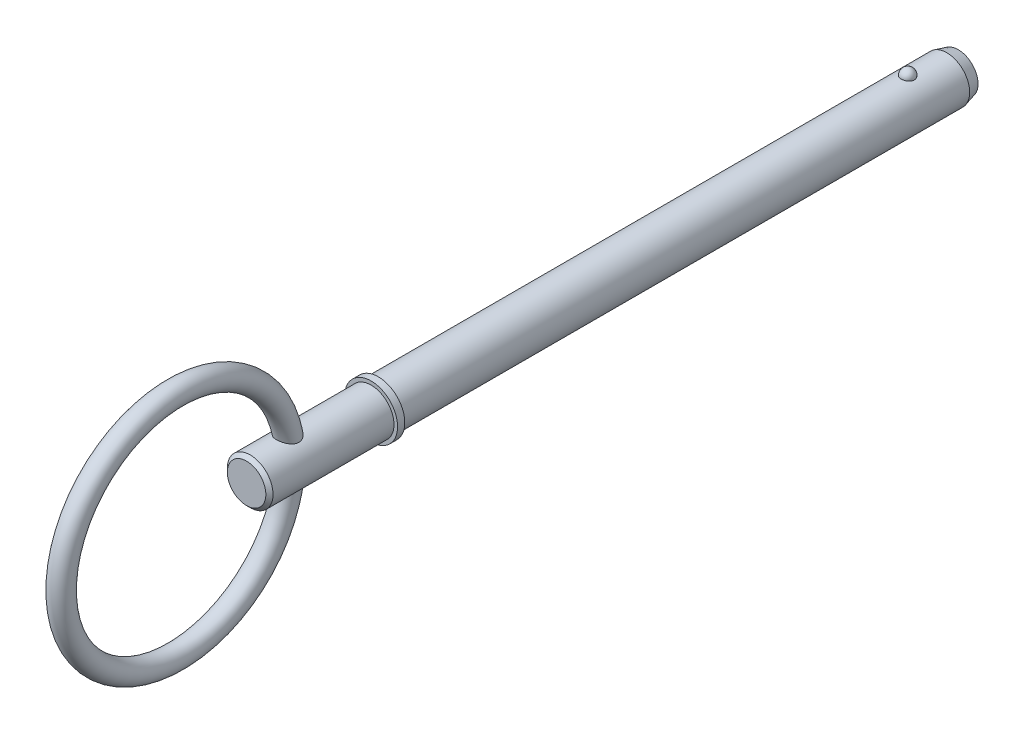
from build123d import *

# Parameters (mm, degrees)
SKETCH2_R           = 3.175
BOSS_EXTRUDE1_DEPTH = 72.6
BOSS_EXTRUDE2_START = 7.92
SKETCH3_R           = 3.175
BOSS_EXTRUDE2_DEPTH = 7.92
CHAMFER1_SIZE       = 1.586
CHAMFER1_SIZE2      = 0.424967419
SKETCH20_W          = 1
SKETCH20_H          = 3.675
SKETCH21_R          = 3.175
BOSS_EXTRUDE3_DEPTH = 18.29
CHAMFER2_SIZE       = 0.5
SKETCH24_R          = 1.5


with BuildPart() as part:
    # Sketch2 → Boss-Extrude1 (new body)
    with BuildSketch(Plane.XY):
        Circle(SKETCH2_R)
    extrude(amount=BOSS_EXTRUDE1_DEPTH)

    # Sketch3 → Boss-Extrude2 (add)
    with BuildSketch(Plane(origin=(0, 0, 0), x_dir=(-1, 0, 0), z_dir=(0, 0, -1)).offset(BOSS_EXTRUDE2_START)):
        Circle(SKETCH3_R)
    extrude(amount=-BOSS_EXTRUDE2_DEPTH)

    # Chamfer1
    chamfer1_edges = [part.edges().sort_by_distance(p)[0] for p in [
        (3.175, 0, -7.92),
    ]]
    chamfer1_side = [part.faces().sort_by_distance(p)[0] for p in [
        (3.175, 0, -3.96),
    ]]
    chamfer(chamfer1_edges, length=CHAMFER1_SIZE, length2=CHAMFER1_SIZE2, reference=chamfer1_side[0])

    # Sketch18 → Revolve1 (revolve)
    with BuildSketch(Plane(origin=(0, 0, 0), x_dir=(0, 0, -1), z_dir=(1, 0, 0))):
        with BuildLine():
            Line((0.91, 4.085), (0.91, 2.265))
            ThreePointArc((0.91, 2.265), (0, 3.175), (0.91, 4.085))
        make_face()
    revolve(axis=Axis((0, 4.085, -0.91), (0, -1, 0)))

    # Sketch20 → Revolve2 (revolve)
    with BuildSketch(Plane(origin=(0, 0, 0), x_dir=(0, 0, -1), z_dir=(1, 0, 0)), mode=Mode.PRIVATE) as revolve2_sk:
        with Locations((-73.1, 1.8375)):
            Rectangle(SKETCH20_W, SKETCH20_H)
    revolve(revolve2_sk.sketch.rotate(Axis((0, 0, 33.728787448), (0, 0, 1)), 90), axis=Axis((0, 0, 33.728787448), (0, 0, 1)))

    # Sketch21 → Boss-Extrude3 (add)
    with BuildSketch(Plane(origin=(0, 0, 72.6), x_dir=(-1, 0, 0), z_dir=(0, 0, -1))):
        Circle(SKETCH21_R)
    extrude(amount=-BOSS_EXTRUDE3_DEPTH)

    # Chamfer2
    chamfer2_edges = [part.edges().sort_by_distance(p)[0] for p in [
        (3.175, 0, 90.89),
    ]]
    chamfer(chamfer2_edges, length=CHAMFER2_SIZE)

    # Sweep1: sweep along a path in Sketch23
    with BuildLine(Plane(origin=(0, 0, 0), x_dir=(0, 0, -1), z_dir=(1, 0, 0))) as sweep1_path:
        CenterArc((-100.765, 0), 15.875, 0, 360)
    # Sketch24 → Sweep1 (sweep)
    with BuildSketch(Plane(origin=(0, 0, 0), x_dir=(1, 0, 0), z_dir=(0, 1, 0))):
        with Locations((0, -84.89)):
            Circle(SKETCH24_R)
    sweep(path=sweep1_path.line)


solid = part.part
